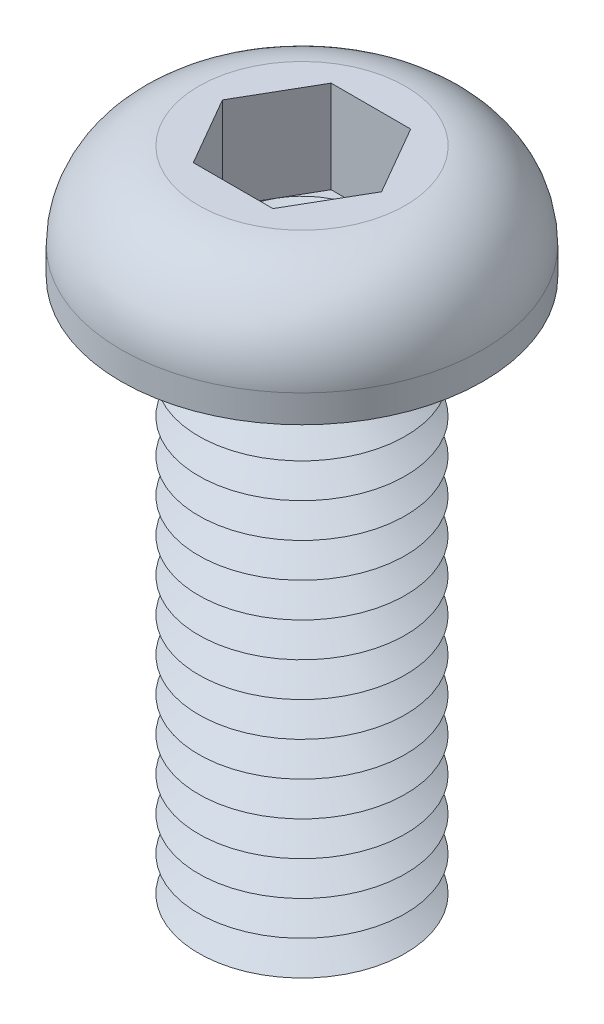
ISO-10303-21;
HEADER;
FILE_DESCRIPTION(('STEP AP214'),'2;1');
FILE_NAME('part.step','',(''),(''),'','','');
FILE_SCHEMA(('AUTOMOTIVE_DESIGN { 1 0 10303 214 1 1 1 1 }'));
ENDSEC;
DATA;
#1=APPLICATION_CONTEXT('core data for automotive mechanical design processes');
#2=APPLICATION_PROTOCOL_DEFINITION('international standard','automotive_design',2000,#1);
#3=PRODUCT_CONTEXT('',#1,'mechanical');
#4=PRODUCT('Part','Part','',(#3));
#5=PRODUCT_RELATED_PRODUCT_CATEGORY('part','',(#4));
#6=PRODUCT_DEFINITION_FORMATION('','',#4);
#7=PRODUCT_DEFINITION_CONTEXT('part definition',#1,'design');
#8=PRODUCT_DEFINITION('design','',#6,#7);
#9=PRODUCT_DEFINITION_SHAPE('','',#8);
#10=(LENGTH_UNIT() NAMED_UNIT(*) SI_UNIT(.MILLI.,.METRE.));
#11=(NAMED_UNIT(*) PLANE_ANGLE_UNIT() SI_UNIT($,.RADIAN.));
#12=(NAMED_UNIT(*) SI_UNIT($,.STERADIAN.) SOLID_ANGLE_UNIT());
#13=UNCERTAINTY_MEASURE_WITH_UNIT(LENGTH_MEASURE(1.E-05),#10,'distance_accuracy_value','');
#14=(GEOMETRIC_REPRESENTATION_CONTEXT(3) GLOBAL_UNCERTAINTY_ASSIGNED_CONTEXT((#13)) GLOBAL_UNIT_ASSIGNED_CONTEXT((#10,
#11,#12)) REPRESENTATION_CONTEXT('',''));
#15=CARTESIAN_POINT('',(0.,0.,0.));
#16=DIRECTION('',(0.,0.,1.));
#17=DIRECTION('',(1.,0.,0.));
#18=AXIS2_PLACEMENT_3D('',#15,#16,#17);
#19=CARTESIAN_POINT('',(0.,0.,0.));
#20=DIRECTION('',(0.,-1.,0.));
#21=DIRECTION('',(0.,0.,-1.));
#22=AXIS2_PLACEMENT_3D('',#19,#20,#21);
#23=TOROIDAL_SURFACE('',#22,3.5,0.5);
#24=CARTESIAN_POINT('',(0.,0.,-4.));
#25=VERTEX_POINT('',#24);
#26=VERTEX_LOOP('',#25);
#27=FACE_BOUND('',#26,.T.);
#28=ADVANCED_FACE('P0_F12',(#27),#23,.T.);
#29=CLOSED_SHELL('',(#28));
#30=MANIFOLD_SOLID_BREP('P0_B1',#29);
#31=CARTESIAN_POINT('',(1.15470053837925,0.62,-2.));
#32=DIRECTION('',(0.,1.,0.));
#33=DIRECTION('',(0.,0.,1.));
#34=AXIS2_PLACEMENT_3D('',#31,#32,#33);
#35=PLANE('',#34);
#36=CARTESIAN_POINT('',(0.,0.62,0.));
#37=DIRECTION('',(0.,1.,0.));
#38=DIRECTION('',(0.,0.,1.));
#39=AXIS2_PLACEMENT_3D('',#36,#37,#38);
#40=CIRCLE('',#39,2.);
#41=CARTESIAN_POINT('',(0.,0.62,2.));
#42=VERTEX_POINT('',#41);
#43=CARTESIAN_POINT('',(1.73205080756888,0.62,1.));
#44=VERTEX_POINT('',#43);
#45=EDGE_CURVE('P1_E93',#42,#44,#40,.T.);
#46=ORIENTED_EDGE('',*,*,#45,.F.);
#47=DIRECTION('',(1.,0.,0.));
#48=VECTOR('',#47,1.);
#49=CARTESIAN_POINT('',(-1.15470053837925,0.62,2.));
#50=LINE('',#49,#48);
#51=CARTESIAN_POINT('',(1.15470053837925,0.62,2.));
#52=VERTEX_POINT('',#51);
#53=EDGE_CURVE('P1_E116',#42,#52,#50,.T.);
#54=ORIENTED_EDGE('',*,*,#53,.T.);
#55=DIRECTION('',(0.5,0.,-0.866025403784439));
#56=VECTOR('',#55,1.);
#57=CARTESIAN_POINT('',(1.15470053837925,0.62,2.));
#58=LINE('',#57,#56);
#59=EDGE_CURVE('P1_E112',#52,#44,#58,.T.);
#60=ORIENTED_EDGE('',*,*,#59,.T.);
#61=EDGE_LOOP('',(#46,#54,#60));
#62=FACE_BOUND('',#61,.T.);
#63=ADVANCED_FACE('P1_F15',(#62),#35,.T.);
#64=CARTESIAN_POINT('',(0.,0.62,0.));
#65=DIRECTION('',(0.,1.,0.));
#66=DIRECTION('',(0.,0.,1.));
#67=AXIS2_PLACEMENT_3D('',#64,#65,#66);
#68=CIRCLE('',#67,2.);
#69=CARTESIAN_POINT('',(1.73205080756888,0.62,-1.));
#70=VERTEX_POINT('',#69);
#71=EDGE_CURVE('P1_E10',#44,#70,#68,.T.);
#72=ORIENTED_EDGE('',*,*,#71,.F.);
#73=CARTESIAN_POINT('',(2.3094010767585,0.62,0.));
#74=VERTEX_POINT('',#73);
#75=EDGE_CURVE('P1_E104',#44,#74,#58,.T.);
#76=ORIENTED_EDGE('',*,*,#75,.T.);
#77=DIRECTION('',(-0.5,0.,-0.866025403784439));
#78=VECTOR('',#77,1.);
#79=CARTESIAN_POINT('',(2.3094010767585,0.62,0.));
#80=LINE('',#79,#78);
#81=EDGE_CURVE('P1_E107',#74,#70,#80,.T.);
#82=ORIENTED_EDGE('',*,*,#81,.T.);
#83=EDGE_LOOP('',(#72,#76,#82));
#84=FACE_BOUND('',#83,.T.);
#85=ADVANCED_FACE('P1_F103',(#84),#35,.T.);
#86=CARTESIAN_POINT('',(0.,0.62,-2.));
#87=VERTEX_POINT('',#86);
#88=EDGE_CURVE('P1_E24',#70,#87,#68,.T.);
#89=ORIENTED_EDGE('',*,*,#88,.F.);
#90=CARTESIAN_POINT('',(1.15470053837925,0.62,-2.));
#91=VERTEX_POINT('',#90);
#92=EDGE_CURVE('P1_E139',#70,#91,#80,.T.);
#93=ORIENTED_EDGE('',*,*,#92,.T.);
#94=DIRECTION('',(-1.,0.,0.));
#95=VECTOR('',#94,1.);
#96=CARTESIAN_POINT('',(1.15470053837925,0.62,-2.));
#97=LINE('',#96,#95);
#98=EDGE_CURVE('P1_E312',#91,#87,#97,.T.);
#99=ORIENTED_EDGE('',*,*,#98,.T.);
#100=EDGE_LOOP('',(#89,#93,#99));
#101=FACE_BOUND('',#100,.T.);
#102=ADVANCED_FACE('P1_F277',(#101),#35,.T.);
#103=CARTESIAN_POINT('',(-1.73205080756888,0.62,-1.));
#104=VERTEX_POINT('',#103);
#105=EDGE_CURVE('P1_E307',#87,#104,#68,.T.);
#106=ORIENTED_EDGE('',*,*,#105,.F.);
#107=CARTESIAN_POINT('',(-1.15470053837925,0.62,-2.));
#108=VERTEX_POINT('',#107);
#109=EDGE_CURVE('P1_E316',#87,#108,#97,.T.);
#110=ORIENTED_EDGE('',*,*,#109,.T.);
#111=DIRECTION('',(-0.5,0.,0.866025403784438));
#112=VECTOR('',#111,1.);
#113=CARTESIAN_POINT('',(-1.15470053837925,0.62,-2.));
#114=LINE('',#113,#112);
#115=EDGE_CURVE('P1_E311',#108,#104,#114,.T.);
#116=ORIENTED_EDGE('',*,*,#115,.T.);
#117=EDGE_LOOP('',(#106,#110,#116));
#118=FACE_BOUND('',#117,.T.);
#119=ADVANCED_FACE('P1_F291',(#118),#35,.T.);
#120=CARTESIAN_POINT('',(-1.73205080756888,0.62,1.));
#121=VERTEX_POINT('',#120);
#122=EDGE_CURVE('P1_E31',#104,#121,#68,.T.);
#123=ORIENTED_EDGE('',*,*,#122,.F.);
#124=CARTESIAN_POINT('',(-2.3094010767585,0.62,0.));
#125=VERTEX_POINT('',#124);
#126=EDGE_CURVE('P1_E303',#104,#125,#114,.T.);
#127=ORIENTED_EDGE('',*,*,#126,.T.);
#128=DIRECTION('',(0.5,0.,0.866025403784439));
#129=VECTOR('',#128,1.);
#130=CARTESIAN_POINT('',(-2.3094010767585,0.62,0.));
#131=LINE('',#130,#129);
#132=EDGE_CURVE('P1_E306',#125,#121,#131,.T.);
#133=ORIENTED_EDGE('',*,*,#132,.T.);
#134=EDGE_LOOP('',(#123,#127,#133));
#135=FACE_BOUND('',#134,.T.);
#136=ADVANCED_FACE('P1_F282',(#135),#35,.T.);
#137=CARTESIAN_POINT('',(0.,-15.,0.));
#138=DIRECTION('',(0.,1.,0.));
#139=DIRECTION('',(0.,0.,1.));
#140=AXIS2_PLACEMENT_3D('',#137,#138,#139);
#141=CONICAL_SURFACE('',#140,2.13397459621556,1.0471975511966);
#142=CARTESIAN_POINT('',(0.,-14.5,0.));
#143=DIRECTION('',(0.,-1.,0.));
#144=DIRECTION('',(0.,0.,-1.));
#145=AXIS2_PLACEMENT_3D('',#142,#143,#144);
#146=CIRCLE('',#145,3.);
#147=CARTESIAN_POINT('',(0.,-14.5,-3.));
#148=VERTEX_POINT('',#147);
#149=EDGE_CURVE('P1_E239',#148,#148,#146,.T.);
#150=ORIENTED_EDGE('',*,*,#149,.T.);
#151=EDGE_LOOP('',(#150));
#152=FACE_BOUND('',#151,.T.);
#153=CARTESIAN_POINT('',(0.,-15.,0.));
#154=DIRECTION('',(0.,-1.,0.));
#155=DIRECTION('',(0.,0.,-1.));
#156=AXIS2_PLACEMENT_3D('',#153,#154,#155);
#157=CIRCLE('',#156,2.13397459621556);
#158=CARTESIAN_POINT('',(0.,-15.,-2.13397459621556));
#159=VERTEX_POINT('',#158);
#160=EDGE_CURVE('P1_E242',#159,#159,#157,.T.);
#161=ORIENTED_EDGE('',*,*,#160,.F.);
#162=EDGE_LOOP('',(#161));
#163=FACE_BOUND('',#162,.T.);
#164=ADVANCED_FACE('P1_F290',(#152,#163),#141,.T.);
#165=CARTESIAN_POINT('',(0.,-15.5,0.));
#166=DIRECTION('',(0.,-1.,0.));
#167=DIRECTION('',(0.,0.,-1.));
#168=AXIS2_PLACEMENT_3D('',#165,#166,#167);
#169=CONICAL_SURFACE('',#168,3.,1.0471975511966);
#170=ORIENTED_EDGE('',*,*,#160,.T.);
#171=EDGE_LOOP('',(#170));
#172=FACE_BOUND('',#171,.T.);
#173=CARTESIAN_POINT('',(0.,-15.5,0.));
#174=DIRECTION('',(0.,-1.,0.));
#175=DIRECTION('',(0.,0.,-1.));
#176=AXIS2_PLACEMENT_3D('',#173,#174,#175);
#177=CIRCLE('',#176,3.);
#178=CARTESIAN_POINT('',(0.,-15.5,-3.));
#179=VERTEX_POINT('',#178);
#180=EDGE_CURVE('P1_E245',#179,#179,#177,.T.);
#181=ORIENTED_EDGE('',*,*,#180,.F.);
#182=EDGE_LOOP('',(#181));
#183=FACE_BOUND('',#182,.T.);
#184=ADVANCED_FACE('P1_F297',(#172,#183),#169,.T.);
#185=CARTESIAN_POINT('',(0.,-16.,0.));
#186=DIRECTION('',(0.,1.,0.));
#187=DIRECTION('',(0.,0.,1.));
#188=AXIS2_PLACEMENT_3D('',#185,#186,#187);
#189=PLANE('',#188);
#190=CARTESIAN_POINT('',(0.,-16.,0.));
#191=DIRECTION('',(0.,-1.,0.));
#192=DIRECTION('',(0.,0.,-1.));
#193=AXIS2_PLACEMENT_3D('',#190,#191,#192);
#194=CIRCLE('',#193,2.13397459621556);
#195=CARTESIAN_POINT('',(0.,-16.,-2.13397459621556));
#196=VERTEX_POINT('',#195);
#197=EDGE_CURVE('P1_E248',#196,#196,#194,.T.);
#198=ORIENTED_EDGE('',*,*,#197,.T.);
#199=EDGE_LOOP('',(#198));
#200=FACE_BOUND('',#199,.T.);
#201=ADVANCED_FACE('P1_F375',(#200),#189,.F.);
#202=CARTESIAN_POINT('',(0.,-16.,0.));
#203=DIRECTION('',(0.,1.,0.));
#204=DIRECTION('',(0.,0.,1.));
#205=AXIS2_PLACEMENT_3D('',#202,#203,#204);
#206=CONICAL_SURFACE('',#205,2.13397459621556,1.0471975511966);
#207=ORIENTED_EDGE('',*,*,#180,.T.);
#208=EDGE_LOOP('',(#207));
#209=FACE_BOUND('',#208,.T.);
#210=ORIENTED_EDGE('',*,*,#197,.F.);
#211=EDGE_LOOP('',(#210));
#212=FACE_BOUND('',#211,.T.);
#213=ADVANCED_FACE('P1_F386',(#209,#212),#206,.T.);
#214=CARTESIAN_POINT('',(0.,-14.,0.));
#215=DIRECTION('',(0.,1.,0.));
#216=DIRECTION('',(0.,0.,1.));
#217=AXIS2_PLACEMENT_3D('',#214,#215,#216);
#218=CONICAL_SURFACE('',#217,2.13397459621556,1.0471975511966);
#219=CARTESIAN_POINT('',(0.,-13.5,0.));
#220=DIRECTION('',(0.,-1.,0.));
#221=DIRECTION('',(0.,0.,-1.));
#222=AXIS2_PLACEMENT_3D('',#219,#220,#221);
#223=CIRCLE('',#222,3.);
#224=CARTESIAN_POINT('',(0.,-13.5,-3.));
#225=VERTEX_POINT('',#224);
#226=EDGE_CURVE('P1_E233',#225,#225,#223,.T.);
#227=ORIENTED_EDGE('',*,*,#226,.T.);
#228=EDGE_LOOP('',(#227));
#229=FACE_BOUND('',#228,.T.);
#230=CARTESIAN_POINT('',(0.,-14.,0.));
#231=DIRECTION('',(0.,-1.,0.));
#232=DIRECTION('',(0.,0.,-1.));
#233=AXIS2_PLACEMENT_3D('',#230,#231,#232);
#234=CIRCLE('',#233,2.13397459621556);
#235=CARTESIAN_POINT('',(0.,-14.,-2.13397459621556));
#236=VERTEX_POINT('',#235);
#237=EDGE_CURVE('P1_E236',#236,#236,#234,.T.);
#238=ORIENTED_EDGE('',*,*,#237,.F.);
#239=EDGE_LOOP('',(#238));
#240=FACE_BOUND('',#239,.T.);
#241=ADVANCED_FACE('P1_F395',(#229,#240),#218,.T.);
#242=CARTESIAN_POINT('',(0.,-14.5,0.));
#243=DIRECTION('',(0.,-1.,0.));
#244=DIRECTION('',(0.,0.,-1.));
#245=AXIS2_PLACEMENT_3D('',#242,#243,#244);
#246=CONICAL_SURFACE('',#245,3.,1.0471975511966);
#247=ORIENTED_EDGE('',*,*,#237,.T.);
#248=EDGE_LOOP('',(#247));
#249=FACE_BOUND('',#248,.T.);
#250=ORIENTED_EDGE('',*,*,#149,.F.);
#251=EDGE_LOOP('',(#250));
#252=FACE_BOUND('',#251,.T.);
#253=ADVANCED_FACE('P1_F404',(#249,#252),#246,.T.);
#254=CARTESIAN_POINT('',(0.,-13.,0.));
#255=DIRECTION('',(0.,1.,0.));
#256=DIRECTION('',(0.,0.,1.));
#257=AXIS2_PLACEMENT_3D('',#254,#255,#256);
#258=CONICAL_SURFACE('',#257,2.13397459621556,1.0471975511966);
#259=CARTESIAN_POINT('',(0.,-12.5,0.));
#260=DIRECTION('',(0.,-1.,0.));
#261=DIRECTION('',(0.,0.,-1.));
#262=AXIS2_PLACEMENT_3D('',#259,#260,#261);
#263=CIRCLE('',#262,3.);
#264=CARTESIAN_POINT('',(0.,-12.5,-3.));
#265=VERTEX_POINT('',#264);
#266=EDGE_CURVE('P1_E227',#265,#265,#263,.T.);
#267=ORIENTED_EDGE('',*,*,#266,.T.);
#268=EDGE_LOOP('',(#267));
#269=FACE_BOUND('',#268,.T.);
#270=CARTESIAN_POINT('',(0.,-13.,0.));
#271=DIRECTION('',(0.,-1.,0.));
#272=DIRECTION('',(0.,0.,-1.));
#273=AXIS2_PLACEMENT_3D('',#270,#271,#272);
#274=CIRCLE('',#273,2.13397459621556);
#275=CARTESIAN_POINT('',(0.,-13.,-2.13397459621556));
#276=VERTEX_POINT('',#275);
#277=EDGE_CURVE('P1_E230',#276,#276,#274,.T.);
#278=ORIENTED_EDGE('',*,*,#277,.F.);
#279=EDGE_LOOP('',(#278));
#280=FACE_BOUND('',#279,.T.);
#281=ADVANCED_FACE('P1_F414',(#269,#280),#258,.T.);
#282=CARTESIAN_POINT('',(0.,-13.5,0.));
#283=DIRECTION('',(0.,-1.,0.));
#284=DIRECTION('',(0.,0.,-1.));
#285=AXIS2_PLACEMENT_3D('',#282,#283,#284);
#286=CONICAL_SURFACE('',#285,3.,1.0471975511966);
#287=ORIENTED_EDGE('',*,*,#277,.T.);
#288=EDGE_LOOP('',(#287));
#289=FACE_BOUND('',#288,.T.);
#290=ORIENTED_EDGE('',*,*,#226,.F.);
#291=EDGE_LOOP('',(#290));
#292=FACE_BOUND('',#291,.T.);
#293=ADVANCED_FACE('P1_F424',(#289,#292),#286,.T.);
#294=CARTESIAN_POINT('',(0.,-12.,0.));
#295=DIRECTION('',(0.,1.,0.));
#296=DIRECTION('',(0.,0.,1.));
#297=AXIS2_PLACEMENT_3D('',#294,#295,#296);
#298=CONICAL_SURFACE('',#297,2.13397459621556,1.0471975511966);
#299=CARTESIAN_POINT('',(0.,-11.5,0.));
#300=DIRECTION('',(0.,-1.,0.));
#301=DIRECTION('',(0.,0.,-1.));
#302=AXIS2_PLACEMENT_3D('',#299,#300,#301);
#303=CIRCLE('',#302,3.);
#304=CARTESIAN_POINT('',(0.,-11.5,-3.));
#305=VERTEX_POINT('',#304);
#306=EDGE_CURVE('P1_E221',#305,#305,#303,.T.);
#307=ORIENTED_EDGE('',*,*,#306,.T.);
#308=EDGE_LOOP('',(#307));
#309=FACE_BOUND('',#308,.T.);
#310=CARTESIAN_POINT('',(0.,-12.,0.));
#311=DIRECTION('',(0.,-1.,0.));
#312=DIRECTION('',(0.,0.,-1.));
#313=AXIS2_PLACEMENT_3D('',#310,#311,#312);
#314=CIRCLE('',#313,2.13397459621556);
#315=CARTESIAN_POINT('',(0.,-12.,-2.13397459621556));
#316=VERTEX_POINT('',#315);
#317=EDGE_CURVE('P1_E224',#316,#316,#314,.T.);
#318=ORIENTED_EDGE('',*,*,#317,.F.);
#319=EDGE_LOOP('',(#318));
#320=FACE_BOUND('',#319,.T.);
#321=ADVANCED_FACE('P1_F434',(#309,#320),#298,.T.);
#322=CARTESIAN_POINT('',(0.,-12.5,0.));
#323=DIRECTION('',(0.,-1.,0.));
#324=DIRECTION('',(0.,0.,-1.));
#325=AXIS2_PLACEMENT_3D('',#322,#323,#324);
#326=CONICAL_SURFACE('',#325,3.,1.0471975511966);
#327=ORIENTED_EDGE('',*,*,#317,.T.);
#328=EDGE_LOOP('',(#327));
#329=FACE_BOUND('',#328,.T.);
#330=ORIENTED_EDGE('',*,*,#266,.F.);
#331=EDGE_LOOP('',(#330));
#332=FACE_BOUND('',#331,.T.);
#333=ADVANCED_FACE('P1_F444',(#329,#332),#326,.T.);
#334=CARTESIAN_POINT('',(0.,-11.,0.));
#335=DIRECTION('',(0.,1.,0.));
#336=DIRECTION('',(0.,0.,1.));
#337=AXIS2_PLACEMENT_3D('',#334,#335,#336);
#338=CONICAL_SURFACE('',#337,2.13397459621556,1.0471975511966);
#339=CARTESIAN_POINT('',(0.,-10.5,0.));
#340=DIRECTION('',(0.,-1.,0.));
#341=DIRECTION('',(0.,0.,-1.));
#342=AXIS2_PLACEMENT_3D('',#339,#340,#341);
#343=CIRCLE('',#342,3.);
#344=CARTESIAN_POINT('',(0.,-10.5,-3.));
#345=VERTEX_POINT('',#344);
#346=EDGE_CURVE('P1_E215',#345,#345,#343,.T.);
#347=ORIENTED_EDGE('',*,*,#346,.T.);
#348=EDGE_LOOP('',(#347));
#349=FACE_BOUND('',#348,.T.);
#350=CARTESIAN_POINT('',(0.,-11.,0.));
#351=DIRECTION('',(0.,-1.,0.));
#352=DIRECTION('',(0.,0.,-1.));
#353=AXIS2_PLACEMENT_3D('',#350,#351,#352);
#354=CIRCLE('',#353,2.13397459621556);
#355=CARTESIAN_POINT('',(0.,-11.,-2.13397459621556));
#356=VERTEX_POINT('',#355);
#357=EDGE_CURVE('P1_E218',#356,#356,#354,.T.);
#358=ORIENTED_EDGE('',*,*,#357,.F.);
#359=EDGE_LOOP('',(#358));
#360=FACE_BOUND('',#359,.T.);
#361=ADVANCED_FACE('P1_F454',(#349,#360),#338,.T.);
#362=CARTESIAN_POINT('',(0.,-11.5,0.));
#363=DIRECTION('',(0.,-1.,0.));
#364=DIRECTION('',(0.,0.,-1.));
#365=AXIS2_PLACEMENT_3D('',#362,#363,#364);
#366=CONICAL_SURFACE('',#365,3.,1.0471975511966);
#367=ORIENTED_EDGE('',*,*,#357,.T.);
#368=EDGE_LOOP('',(#367));
#369=FACE_BOUND('',#368,.T.);
#370=ORIENTED_EDGE('',*,*,#306,.F.);
#371=EDGE_LOOP('',(#370));
#372=FACE_BOUND('',#371,.T.);
#373=ADVANCED_FACE('P1_F464',(#369,#372),#366,.T.);
#374=CARTESIAN_POINT('',(0.,-10.,0.));
#375=DIRECTION('',(0.,1.,0.));
#376=DIRECTION('',(0.,0.,1.));
#377=AXIS2_PLACEMENT_3D('',#374,#375,#376);
#378=CONICAL_SURFACE('',#377,2.13397459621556,1.0471975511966);
#379=CARTESIAN_POINT('',(0.,-9.5,0.));
#380=DIRECTION('',(0.,-1.,0.));
#381=DIRECTION('',(0.,0.,-1.));
#382=AXIS2_PLACEMENT_3D('',#379,#380,#381);
#383=CIRCLE('',#382,3.);
#384=CARTESIAN_POINT('',(0.,-9.5,-3.));
#385=VERTEX_POINT('',#384);
#386=EDGE_CURVE('P1_E209',#385,#385,#383,.T.);
#387=ORIENTED_EDGE('',*,*,#386,.T.);
#388=EDGE_LOOP('',(#387));
#389=FACE_BOUND('',#388,.T.);
#390=CARTESIAN_POINT('',(0.,-10.,0.));
#391=DIRECTION('',(0.,-1.,0.));
#392=DIRECTION('',(0.,0.,-1.));
#393=AXIS2_PLACEMENT_3D('',#390,#391,#392);
#394=CIRCLE('',#393,2.13397459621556);
#395=CARTESIAN_POINT('',(0.,-10.,-2.13397459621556));
#396=VERTEX_POINT('',#395);
#397=EDGE_CURVE('P1_E212',#396,#396,#394,.T.);
#398=ORIENTED_EDGE('',*,*,#397,.F.);
#399=EDGE_LOOP('',(#398));
#400=FACE_BOUND('',#399,.T.);
#401=ADVANCED_FACE('P1_F474',(#389,#400),#378,.T.);
#402=CARTESIAN_POINT('',(0.,-10.5,0.));
#403=DIRECTION('',(0.,-1.,0.));
#404=DIRECTION('',(0.,0.,-1.));
#405=AXIS2_PLACEMENT_3D('',#402,#403,#404);
#406=CONICAL_SURFACE('',#405,3.,1.0471975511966);
#407=ORIENTED_EDGE('',*,*,#397,.T.);
#408=EDGE_LOOP('',(#407));
#409=FACE_BOUND('',#408,.T.);
#410=ORIENTED_EDGE('',*,*,#346,.F.);
#411=EDGE_LOOP('',(#410));
#412=FACE_BOUND('',#411,.T.);
#413=ADVANCED_FACE('P1_F484',(#409,#412),#406,.T.);
#414=CARTESIAN_POINT('',(0.,-9.,0.));
#415=DIRECTION('',(0.,1.,0.));
#416=DIRECTION('',(0.,0.,1.));
#417=AXIS2_PLACEMENT_3D('',#414,#415,#416);
#418=CONICAL_SURFACE('',#417,2.13397459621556,1.0471975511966);
#419=CARTESIAN_POINT('',(0.,-8.5,0.));
#420=DIRECTION('',(0.,-1.,0.));
#421=DIRECTION('',(0.,0.,-1.));
#422=AXIS2_PLACEMENT_3D('',#419,#420,#421);
#423=CIRCLE('',#422,3.);
#424=CARTESIAN_POINT('',(0.,-8.5,-3.));
#425=VERTEX_POINT('',#424);
#426=EDGE_CURVE('P1_E203',#425,#425,#423,.T.);
#427=ORIENTED_EDGE('',*,*,#426,.T.);
#428=EDGE_LOOP('',(#427));
#429=FACE_BOUND('',#428,.T.);
#430=CARTESIAN_POINT('',(0.,-9.,0.));
#431=DIRECTION('',(0.,-1.,0.));
#432=DIRECTION('',(0.,0.,-1.));
#433=AXIS2_PLACEMENT_3D('',#430,#431,#432);
#434=CIRCLE('',#433,2.13397459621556);
#435=CARTESIAN_POINT('',(0.,-9.,-2.13397459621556));
#436=VERTEX_POINT('',#435);
#437=EDGE_CURVE('P1_E206',#436,#436,#434,.T.);
#438=ORIENTED_EDGE('',*,*,#437,.F.);
#439=EDGE_LOOP('',(#438));
#440=FACE_BOUND('',#439,.T.);
#441=ADVANCED_FACE('P1_F494',(#429,#440),#418,.T.);
#442=CARTESIAN_POINT('',(0.,-9.5,0.));
#443=DIRECTION('',(0.,-1.,0.));
#444=DIRECTION('',(0.,0.,-1.));
#445=AXIS2_PLACEMENT_3D('',#442,#443,#444);
#446=CONICAL_SURFACE('',#445,3.,1.0471975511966);
#447=ORIENTED_EDGE('',*,*,#437,.T.);
#448=EDGE_LOOP('',(#447));
#449=FACE_BOUND('',#448,.T.);
#450=ORIENTED_EDGE('',*,*,#386,.F.);
#451=EDGE_LOOP('',(#450));
#452=FACE_BOUND('',#451,.T.);
#453=ADVANCED_FACE('P1_F504',(#449,#452),#446,.T.);
#454=CARTESIAN_POINT('',(0.,-8.,0.));
#455=DIRECTION('',(0.,1.,0.));
#456=DIRECTION('',(0.,0.,1.));
#457=AXIS2_PLACEMENT_3D('',#454,#455,#456);
#458=CONICAL_SURFACE('',#457,2.13397459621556,1.0471975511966);
#459=CARTESIAN_POINT('',(0.,-7.5,0.));
#460=DIRECTION('',(0.,-1.,0.));
#461=DIRECTION('',(0.,0.,-1.));
#462=AXIS2_PLACEMENT_3D('',#459,#460,#461);
#463=CIRCLE('',#462,3.);
#464=CARTESIAN_POINT('',(0.,-7.5,-3.));
#465=VERTEX_POINT('',#464);
#466=EDGE_CURVE('P1_E197',#465,#465,#463,.T.);
#467=ORIENTED_EDGE('',*,*,#466,.T.);
#468=EDGE_LOOP('',(#467));
#469=FACE_BOUND('',#468,.T.);
#470=CARTESIAN_POINT('',(0.,-8.,0.));
#471=DIRECTION('',(0.,-1.,0.));
#472=DIRECTION('',(0.,0.,-1.));
#473=AXIS2_PLACEMENT_3D('',#470,#471,#472);
#474=CIRCLE('',#473,2.13397459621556);
#475=CARTESIAN_POINT('',(0.,-8.,-2.13397459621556));
#476=VERTEX_POINT('',#475);
#477=EDGE_CURVE('P1_E200',#476,#476,#474,.T.);
#478=ORIENTED_EDGE('',*,*,#477,.F.);
#479=EDGE_LOOP('',(#478));
#480=FACE_BOUND('',#479,.T.);
#481=ADVANCED_FACE('P1_F514',(#469,#480),#458,.T.);
#482=CARTESIAN_POINT('',(0.,-8.5,0.));
#483=DIRECTION('',(0.,-1.,0.));
#484=DIRECTION('',(0.,0.,-1.));
#485=AXIS2_PLACEMENT_3D('',#482,#483,#484);
#486=CONICAL_SURFACE('',#485,3.,1.0471975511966);
#487=ORIENTED_EDGE('',*,*,#477,.T.);
#488=EDGE_LOOP('',(#487));
#489=FACE_BOUND('',#488,.T.);
#490=ORIENTED_EDGE('',*,*,#426,.F.);
#491=EDGE_LOOP('',(#490));
#492=FACE_BOUND('',#491,.T.);
#493=ADVANCED_FACE('P1_F524',(#489,#492),#486,.T.);
#494=CARTESIAN_POINT('',(0.,-7.,0.));
#495=DIRECTION('',(0.,1.,0.));
#496=DIRECTION('',(0.,0.,1.));
#497=AXIS2_PLACEMENT_3D('',#494,#495,#496);
#498=CONICAL_SURFACE('',#497,2.13397459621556,1.0471975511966);
#499=CARTESIAN_POINT('',(0.,-6.5,0.));
#500=DIRECTION('',(0.,-1.,0.));
#501=DIRECTION('',(0.,0.,-1.));
#502=AXIS2_PLACEMENT_3D('',#499,#500,#501);
#503=CIRCLE('',#502,3.);
#504=CARTESIAN_POINT('',(0.,-6.5,-3.));
#505=VERTEX_POINT('',#504);
#506=EDGE_CURVE('P1_E191',#505,#505,#503,.T.);
#507=ORIENTED_EDGE('',*,*,#506,.T.);
#508=EDGE_LOOP('',(#507));
#509=FACE_BOUND('',#508,.T.);
#510=CARTESIAN_POINT('',(0.,-7.,0.));
#511=DIRECTION('',(0.,-1.,0.));
#512=DIRECTION('',(0.,0.,-1.));
#513=AXIS2_PLACEMENT_3D('',#510,#511,#512);
#514=CIRCLE('',#513,2.13397459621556);
#515=CARTESIAN_POINT('',(0.,-7.,-2.13397459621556));
#516=VERTEX_POINT('',#515);
#517=EDGE_CURVE('P1_E194',#516,#516,#514,.T.);
#518=ORIENTED_EDGE('',*,*,#517,.F.);
#519=EDGE_LOOP('',(#518));
#520=FACE_BOUND('',#519,.T.);
#521=ADVANCED_FACE('P1_F534',(#509,#520),#498,.T.);
#522=CARTESIAN_POINT('',(0.,-7.5,0.));
#523=DIRECTION('',(0.,-1.,0.));
#524=DIRECTION('',(0.,0.,-1.));
#525=AXIS2_PLACEMENT_3D('',#522,#523,#524);
#526=CONICAL_SURFACE('',#525,3.,1.0471975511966);
#527=ORIENTED_EDGE('',*,*,#517,.T.);
#528=EDGE_LOOP('',(#527));
#529=FACE_BOUND('',#528,.T.);
#530=ORIENTED_EDGE('',*,*,#466,.F.);
#531=EDGE_LOOP('',(#530));
#532=FACE_BOUND('',#531,.T.);
#533=ADVANCED_FACE('P1_F544',(#529,#532),#526,.T.);
#534=CARTESIAN_POINT('',(0.,-6.,0.));
#535=DIRECTION('',(0.,1.,0.));
#536=DIRECTION('',(0.,0.,1.));
#537=AXIS2_PLACEMENT_3D('',#534,#535,#536);
#538=CONICAL_SURFACE('',#537,2.13397459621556,1.0471975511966);
#539=CARTESIAN_POINT('',(0.,-5.5,0.));
#540=DIRECTION('',(0.,-1.,0.));
#541=DIRECTION('',(0.,0.,-1.));
#542=AXIS2_PLACEMENT_3D('',#539,#540,#541);
#543=CIRCLE('',#542,3.);
#544=CARTESIAN_POINT('',(0.,-5.5,-3.));
#545=VERTEX_POINT('',#544);
#546=EDGE_CURVE('P1_E185',#545,#545,#543,.T.);
#547=ORIENTED_EDGE('',*,*,#546,.T.);
#548=EDGE_LOOP('',(#547));
#549=FACE_BOUND('',#548,.T.);
#550=CARTESIAN_POINT('',(0.,-6.,0.));
#551=DIRECTION('',(0.,-1.,0.));
#552=DIRECTION('',(0.,0.,-1.));
#553=AXIS2_PLACEMENT_3D('',#550,#551,#552);
#554=CIRCLE('',#553,2.13397459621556);
#555=CARTESIAN_POINT('',(0.,-6.,-2.13397459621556));
#556=VERTEX_POINT('',#555);
#557=EDGE_CURVE('P1_E188',#556,#556,#554,.T.);
#558=ORIENTED_EDGE('',*,*,#557,.F.);
#559=EDGE_LOOP('',(#558));
#560=FACE_BOUND('',#559,.T.);
#561=ADVANCED_FACE('P1_F554',(#549,#560),#538,.T.);
#562=CARTESIAN_POINT('',(0.,-6.5,0.));
#563=DIRECTION('',(0.,-1.,0.));
#564=DIRECTION('',(0.,0.,-1.));
#565=AXIS2_PLACEMENT_3D('',#562,#563,#564);
#566=CONICAL_SURFACE('',#565,3.,1.0471975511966);
#567=ORIENTED_EDGE('',*,*,#557,.T.);
#568=EDGE_LOOP('',(#567));
#569=FACE_BOUND('',#568,.T.);
#570=ORIENTED_EDGE('',*,*,#506,.F.);
#571=EDGE_LOOP('',(#570));
#572=FACE_BOUND('',#571,.T.);
#573=ADVANCED_FACE('P1_F564',(#569,#572),#566,.T.);
#574=CARTESIAN_POINT('',(0.,-5.,0.));
#575=DIRECTION('',(0.,1.,0.));
#576=DIRECTION('',(0.,0.,1.));
#577=AXIS2_PLACEMENT_3D('',#574,#575,#576);
#578=CONICAL_SURFACE('',#577,2.13397459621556,1.0471975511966);
#579=CARTESIAN_POINT('',(0.,-4.5,0.));
#580=DIRECTION('',(0.,-1.,0.));
#581=DIRECTION('',(0.,0.,-1.));
#582=AXIS2_PLACEMENT_3D('',#579,#580,#581);
#583=CIRCLE('',#582,3.);
#584=CARTESIAN_POINT('',(0.,-4.5,-3.));
#585=VERTEX_POINT('',#584);
#586=EDGE_CURVE('P1_E179',#585,#585,#583,.T.);
#587=ORIENTED_EDGE('',*,*,#586,.T.);
#588=EDGE_LOOP('',(#587));
#589=FACE_BOUND('',#588,.T.);
#590=CARTESIAN_POINT('',(0.,-5.,0.));
#591=DIRECTION('',(0.,-1.,0.));
#592=DIRECTION('',(0.,0.,-1.));
#593=AXIS2_PLACEMENT_3D('',#590,#591,#592);
#594=CIRCLE('',#593,2.13397459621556);
#595=CARTESIAN_POINT('',(0.,-5.,-2.13397459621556));
#596=VERTEX_POINT('',#595);
#597=EDGE_CURVE('P1_E182',#596,#596,#594,.T.);
#598=ORIENTED_EDGE('',*,*,#597,.F.);
#599=EDGE_LOOP('',(#598));
#600=FACE_BOUND('',#599,.T.);
#601=ADVANCED_FACE('P1_F574',(#589,#600),#578,.T.);
#602=CARTESIAN_POINT('',(0.,-5.5,0.));
#603=DIRECTION('',(0.,-1.,0.));
#604=DIRECTION('',(0.,0.,-1.));
#605=AXIS2_PLACEMENT_3D('',#602,#603,#604);
#606=CONICAL_SURFACE('',#605,3.,1.0471975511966);
#607=ORIENTED_EDGE('',*,*,#597,.T.);
#608=EDGE_LOOP('',(#607));
#609=FACE_BOUND('',#608,.T.);
#610=ORIENTED_EDGE('',*,*,#546,.F.);
#611=EDGE_LOOP('',(#610));
#612=FACE_BOUND('',#611,.T.);
#613=ADVANCED_FACE('P1_F584',(#609,#612),#606,.T.);
#614=CARTESIAN_POINT('',(0.,-4.,0.));
#615=DIRECTION('',(0.,1.,0.));
#616=DIRECTION('',(0.,0.,1.));
#617=AXIS2_PLACEMENT_3D('',#614,#615,#616);
#618=CONICAL_SURFACE('',#617,2.13397459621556,1.0471975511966);
#619=CARTESIAN_POINT('',(0.,-3.5,0.));
#620=DIRECTION('',(0.,-1.,0.));
#621=DIRECTION('',(0.,0.,-1.));
#622=AXIS2_PLACEMENT_3D('',#619,#620,#621);
#623=CIRCLE('',#622,3.);
#624=CARTESIAN_POINT('',(0.,-3.5,-3.));
#625=VERTEX_POINT('',#624);
#626=EDGE_CURVE('P1_E173',#625,#625,#623,.T.);
#627=ORIENTED_EDGE('',*,*,#626,.T.);
#628=EDGE_LOOP('',(#627));
#629=FACE_BOUND('',#628,.T.);
#630=CARTESIAN_POINT('',(0.,-4.,0.));
#631=DIRECTION('',(0.,-1.,0.));
#632=DIRECTION('',(0.,0.,-1.));
#633=AXIS2_PLACEMENT_3D('',#630,#631,#632);
#634=CIRCLE('',#633,2.13397459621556);
#635=CARTESIAN_POINT('',(0.,-4.,-2.13397459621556));
#636=VERTEX_POINT('',#635);
#637=EDGE_CURVE('P1_E176',#636,#636,#634,.T.);
#638=ORIENTED_EDGE('',*,*,#637,.F.);
#639=EDGE_LOOP('',(#638));
#640=FACE_BOUND('',#639,.T.);
#641=ADVANCED_FACE('P1_F594',(#629,#640),#618,.T.);
#642=CARTESIAN_POINT('',(0.,-4.5,0.));
#643=DIRECTION('',(0.,-1.,0.));
#644=DIRECTION('',(0.,0.,-1.));
#645=AXIS2_PLACEMENT_3D('',#642,#643,#644);
#646=CONICAL_SURFACE('',#645,3.,1.0471975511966);
#647=ORIENTED_EDGE('',*,*,#637,.T.);
#648=EDGE_LOOP('',(#647));
#649=FACE_BOUND('',#648,.T.);
#650=ORIENTED_EDGE('',*,*,#586,.F.);
#651=EDGE_LOOP('',(#650));
#652=FACE_BOUND('',#651,.T.);
#653=ADVANCED_FACE('P1_F604',(#649,#652),#646,.T.);
#654=CARTESIAN_POINT('',(0.,-3.,0.));
#655=DIRECTION('',(0.,1.,0.));
#656=DIRECTION('',(0.,0.,1.));
#657=AXIS2_PLACEMENT_3D('',#654,#655,#656);
#658=CONICAL_SURFACE('',#657,2.13397459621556,1.0471975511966);
#659=CARTESIAN_POINT('',(0.,-2.5,0.));
#660=DIRECTION('',(0.,-1.,0.));
#661=DIRECTION('',(0.,0.,-1.));
#662=AXIS2_PLACEMENT_3D('',#659,#660,#661);
#663=CIRCLE('',#662,3.);
#664=CARTESIAN_POINT('',(0.,-2.5,-3.));
#665=VERTEX_POINT('',#664);
#666=EDGE_CURVE('P1_E164',#665,#665,#663,.T.);
#667=ORIENTED_EDGE('',*,*,#666,.T.);
#668=EDGE_LOOP('',(#667));
#669=FACE_BOUND('',#668,.T.);
#670=CARTESIAN_POINT('',(0.,-3.,0.));
#671=DIRECTION('',(0.,-1.,0.));
#672=DIRECTION('',(0.,0.,-1.));
#673=AXIS2_PLACEMENT_3D('',#670,#671,#672);
#674=CIRCLE('',#673,2.13397459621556);
#675=CARTESIAN_POINT('',(0.,-3.,-2.13397459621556));
#676=VERTEX_POINT('',#675);
#677=EDGE_CURVE('P1_E170',#676,#676,#674,.T.);
#678=ORIENTED_EDGE('',*,*,#677,.F.);
#679=EDGE_LOOP('',(#678));
#680=FACE_BOUND('',#679,.T.);
#681=ADVANCED_FACE('P1_F614',(#669,#680),#658,.T.);
#682=CARTESIAN_POINT('',(0.,-3.5,0.));
#683=DIRECTION('',(0.,-1.,0.));
#684=DIRECTION('',(0.,0.,-1.));
#685=AXIS2_PLACEMENT_3D('',#682,#683,#684);
#686=CONICAL_SURFACE('',#685,3.,1.0471975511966);
#687=ORIENTED_EDGE('',*,*,#677,.T.);
#688=EDGE_LOOP('',(#687));
#689=FACE_BOUND('',#688,.T.);
#690=ORIENTED_EDGE('',*,*,#626,.F.);
#691=EDGE_LOOP('',(#690));
#692=FACE_BOUND('',#691,.T.);
#693=ADVANCED_FACE('P1_F624',(#689,#692),#686,.T.);
#694=CARTESIAN_POINT('',(0.,-2.,0.));
#695=DIRECTION('',(0.,1.,0.));
#696=DIRECTION('',(0.,0.,1.));
#697=AXIS2_PLACEMENT_3D('',#694,#695,#696);
#698=CONICAL_SURFACE('',#697,2.13397459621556,1.0471975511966);
#699=CARTESIAN_POINT('',(0.,-1.5,0.));
#700=DIRECTION('',(0.,-1.,0.));
#701=DIRECTION('',(0.,0.,-1.));
#702=AXIS2_PLACEMENT_3D('',#699,#700,#701);
#703=CIRCLE('',#702,3.);
#704=CARTESIAN_POINT('',(0.,-1.5,-3.));
#705=VERTEX_POINT('',#704);
#706=EDGE_CURVE('P1_E167',#705,#705,#703,.T.);
#707=ORIENTED_EDGE('',*,*,#706,.T.);
#708=EDGE_LOOP('',(#707));
#709=FACE_BOUND('',#708,.T.);
#710=CARTESIAN_POINT('',(0.,-2.,0.));
#711=DIRECTION('',(0.,-1.,0.));
#712=DIRECTION('',(0.,0.,-1.));
#713=AXIS2_PLACEMENT_3D('',#710,#711,#712);
#714=CIRCLE('',#713,2.13397459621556);
#715=CARTESIAN_POINT('',(0.,-2.,-2.13397459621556));
#716=VERTEX_POINT('',#715);
#717=EDGE_CURVE('P1_E161',#716,#716,#714,.T.);
#718=ORIENTED_EDGE('',*,*,#717,.F.);
#719=EDGE_LOOP('',(#718));
#720=FACE_BOUND('',#719,.T.);
#721=ADVANCED_FACE('P1_F634',(#709,#720),#698,.T.);
#722=CARTESIAN_POINT('',(0.,-2.5,0.));
#723=DIRECTION('',(0.,-1.,0.));
#724=DIRECTION('',(0.,0.,-1.));
#725=AXIS2_PLACEMENT_3D('',#722,#723,#724);
#726=CONICAL_SURFACE('',#725,3.,1.0471975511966);
#727=ORIENTED_EDGE('',*,*,#717,.T.);
#728=EDGE_LOOP('',(#727));
#729=FACE_BOUND('',#728,.T.);
#730=ORIENTED_EDGE('',*,*,#666,.F.);
#731=EDGE_LOOP('',(#730));
#732=FACE_BOUND('',#731,.T.);
#733=ADVANCED_FACE('P1_F644',(#729,#732),#726,.T.);
#734=CARTESIAN_POINT('',(0.,-16.,0.));
#735=DIRECTION('',(0.,1.,0.));
#736=DIRECTION('',(0.,0.,1.));
#737=AXIS2_PLACEMENT_3D('',#734,#735,#736);
#738=CYLINDRICAL_SURFACE('',#737,3.);
#739=CARTESIAN_POINT('',(0.,0.,0.));
#740=DIRECTION('',(0.,-1.,0.));
#741=DIRECTION('',(1.,0.,0.));
#742=AXIS2_PLACEMENT_3D('',#739,#740,#741);
#743=CIRCLE('',#742,3.);
#744=CARTESIAN_POINT('',(3.,0.,0.));
#745=VERTEX_POINT('',#744);
#746=EDGE_CURVE('P1_E141',#745,#745,#743,.F.);
#747=ORIENTED_EDGE('',*,*,#746,.F.);
#748=EDGE_LOOP('',(#747));
#749=FACE_BOUND('',#748,.T.);
#750=ORIENTED_EDGE('',*,*,#706,.F.);
#751=EDGE_LOOP('',(#750));
#752=FACE_BOUND('',#751,.T.);
#753=ADVANCED_FACE('P1_F17',(#749,#752),#738,.T.);
#754=CARTESIAN_POINT('',(0.,0.,0.));
#755=DIRECTION('',(0.,-1.,0.));
#756=DIRECTION('',(0.,0.,-1.));
#757=AXIS2_PLACEMENT_3D('',#754,#755,#756);
#758=TOROIDAL_SURFACE('',#757,3.5,0.5);
#759=ORIENTED_EDGE('',*,*,#746,.T.);
#760=EDGE_LOOP('',(#759));
#761=FACE_BOUND('',#760,.T.);
#762=CARTESIAN_POINT('',(0.,0.,0.));
#763=DIRECTION('',(0.,1.,0.));
#764=DIRECTION('',(-1.,0.,0.));
#765=AXIS2_PLACEMENT_3D('',#762,#763,#764);
#766=CIRCLE('',#765,4.);
#767=CARTESIAN_POINT('',(-4.,0.,0.));
#768=VERTEX_POINT('',#767);
#769=EDGE_CURVE('P1_E151',#768,#768,#766,.F.);
#770=ORIENTED_EDGE('',*,*,#769,.T.);
#771=EDGE_LOOP('',(#770));
#772=FACE_BOUND('',#771,.T.);
#773=ADVANCED_FACE('P1_F253',(#761,#772),#758,.F.);
#774=CARTESIAN_POINT('',(3.,3.3,0.));
#775=DIRECTION('',(0.,-1.,0.));
#776=DIRECTION('',(1.,0.,0.));
#777=AXIS2_PLACEMENT_3D('',#774,#775,#776);
#778=PLANE('',#777);
#779=DIRECTION('',(-1.,0.,0.));
#780=VECTOR('',#779,1.);
#781=CARTESIAN_POINT('',(1.15470053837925,3.3,-2.));
#782=LINE('',#781,#780);
#783=CARTESIAN_POINT('',(1.15470053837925,3.3,-2.));
#784=VERTEX_POINT('',#783);
#785=CARTESIAN_POINT('',(-1.15470053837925,3.3,-2.));
#786=VERTEX_POINT('',#785);
#787=EDGE_CURVE('P1_E125',#784,#786,#782,.T.);
#788=ORIENTED_EDGE('',*,*,#787,.F.);
#789=DIRECTION('',(-0.5,0.,-0.866025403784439));
#790=VECTOR('',#789,1.);
#791=CARTESIAN_POINT('',(2.3094010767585,3.3,0.));
#792=LINE('',#791,#790);
#793=CARTESIAN_POINT('',(2.3094010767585,3.3,0.));
#794=VERTEX_POINT('',#793);
#795=EDGE_CURVE('P1_E39',#794,#784,#792,.T.);
#796=ORIENTED_EDGE('',*,*,#795,.F.);
#797=DIRECTION('',(0.5,0.,-0.866025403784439));
#798=VECTOR('',#797,1.);
#799=CARTESIAN_POINT('',(1.15470053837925,3.3,2.));
#800=LINE('',#799,#798);
#801=CARTESIAN_POINT('',(1.15470053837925,3.3,2.));
#802=VERTEX_POINT('',#801);
#803=EDGE_CURVE('P1_E137',#802,#794,#800,.T.);
#804=ORIENTED_EDGE('',*,*,#803,.F.);
#805=DIRECTION('',(1.,0.,0.));
#806=VECTOR('',#805,1.);
#807=CARTESIAN_POINT('',(-1.15470053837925,3.3,2.));
#808=LINE('',#807,#806);
#809=CARTESIAN_POINT('',(-1.15470053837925,3.3,2.));
#810=VERTEX_POINT('',#809);
#811=EDGE_CURVE('P1_E134',#810,#802,#808,.T.);
#812=ORIENTED_EDGE('',*,*,#811,.F.);
#813=DIRECTION('',(0.5,0.,0.866025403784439));
#814=VECTOR('',#813,1.);
#815=CARTESIAN_POINT('',(-2.3094010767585,3.3,0.));
#816=LINE('',#815,#814);
#817=CARTESIAN_POINT('',(-2.3094010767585,3.3,0.));
#818=VERTEX_POINT('',#817);
#819=EDGE_CURVE('P1_E131',#818,#810,#816,.T.);
#820=ORIENTED_EDGE('',*,*,#819,.F.);
#821=DIRECTION('',(-0.5,0.,0.866025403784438));
#822=VECTOR('',#821,1.);
#823=CARTESIAN_POINT('',(-1.15470053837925,3.3,-2.));
#824=LINE('',#823,#822);
#825=EDGE_CURVE('P1_E128',#786,#818,#824,.T.);
#826=ORIENTED_EDGE('',*,*,#825,.F.);
#827=EDGE_LOOP('',(#788,#796,#804,#812,#820,#826));
#828=FACE_BOUND('',#827,.T.);
#829=CARTESIAN_POINT('',(0.,3.3,0.));
#830=DIRECTION('',(0.,1.,0.));
#831=DIRECTION('',(-1.,0.,0.));
#832=AXIS2_PLACEMENT_3D('',#829,#830,#831);
#833=CIRCLE('',#832,3.);
#834=CARTESIAN_POINT('',(-3.,3.3,0.));
#835=VERTEX_POINT('',#834);
#836=EDGE_CURVE('P1_E152',#835,#835,#833,.T.);
#837=ORIENTED_EDGE('',*,*,#836,.T.);
#838=EDGE_LOOP('',(#837));
#839=FACE_BOUND('',#838,.T.);
#840=ADVANCED_FACE('P1_F331',(#828,#839),#778,.F.);
#841=CARTESIAN_POINT('',(0.,0.8,0.));
#842=DIRECTION('',(0.,1.,0.));
#843=DIRECTION('',(-1.,0.,0.));
#844=AXIS2_PLACEMENT_3D('',#841,#842,#843);
#845=TOROIDAL_SURFACE('',#844,2.73611111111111,2.51388888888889);
#846=ORIENTED_EDGE('',*,*,#836,.F.);
#847=EDGE_LOOP('',(#846));
#848=FACE_BOUND('',#847,.T.);
#849=CARTESIAN_POINT('',(0.,0.8,0.));
#850=DIRECTION('',(0.,1.,0.));
#851=DIRECTION('',(-1.,0.,0.));
#852=AXIS2_PLACEMENT_3D('',#849,#850,#851);
#853=CIRCLE('',#852,5.25);
#854=CARTESIAN_POINT('',(-5.25,0.8,0.));
#855=VERTEX_POINT('',#854);
#856=EDGE_CURVE('P1_E155',#855,#855,#853,.T.);
#857=ORIENTED_EDGE('',*,*,#856,.T.);
#858=EDGE_LOOP('',(#857));
#859=FACE_BOUND('',#858,.T.);
#860=ADVANCED_FACE('P1_F267',(#848,#859),#845,.T.);
#861=CARTESIAN_POINT('',(0.,3.3,0.));
#862=DIRECTION('',(0.,1.,0.));
#863=DIRECTION('',(-1.,0.,0.));
#864=AXIS2_PLACEMENT_3D('',#861,#862,#863);
#865=CYLINDRICAL_SURFACE('',#864,5.25);
#866=ORIENTED_EDGE('',*,*,#856,.F.);
#867=EDGE_LOOP('',(#866));
#868=FACE_BOUND('',#867,.T.);
#869=CARTESIAN_POINT('',(0.,0.,0.));
#870=DIRECTION('',(0.,1.,0.));
#871=DIRECTION('',(-1.,0.,0.));
#872=AXIS2_PLACEMENT_3D('',#869,#870,#871);
#873=CIRCLE('',#872,5.25);
#874=CARTESIAN_POINT('',(-5.25,0.,0.));
#875=VERTEX_POINT('',#874);
#876=EDGE_CURVE('P1_E158',#875,#875,#873,.T.);
#877=ORIENTED_EDGE('',*,*,#876,.T.);
#878=EDGE_LOOP('',(#877));
#879=FACE_BOUND('',#878,.T.);
#880=ADVANCED_FACE('P1_F258',(#868,#879),#865,.T.);
#881=CARTESIAN_POINT('',(0.,0.,0.));
#882=DIRECTION('',(0.,1.,0.));
#883=DIRECTION('',(-1.,0.,0.));
#884=AXIS2_PLACEMENT_3D('',#881,#882,#883);
#885=PLANE('',#884);
#886=ORIENTED_EDGE('',*,*,#876,.F.);
#887=EDGE_LOOP('',(#886));
#888=FACE_BOUND('',#887,.T.);
#889=ORIENTED_EDGE('',*,*,#769,.F.);
#890=EDGE_LOOP('',(#889));
#891=FACE_BOUND('',#890,.T.);
#892=ADVANCED_FACE('P1_F255',(#888,#891),#885,.F.);
#893=CARTESIAN_POINT('',(2.3094010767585,0.62,0.));
#894=DIRECTION('',(0.866025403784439,0.,-0.5));
#895=DIRECTION('',(-0.5,0.,-0.866025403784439));
#896=AXIS2_PLACEMENT_3D('',#893,#894,#895);
#897=PLANE('',#896);
#898=ORIENTED_EDGE('',*,*,#795,.T.);
#899=DIRECTION('',(0.,1.,0.));
#900=VECTOR('',#899,1.);
#901=CARTESIAN_POINT('',(1.15470053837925,0.62,-2.));
#902=LINE('',#901,#900);
#903=EDGE_CURVE('P1_E118',#91,#784,#902,.T.);
#904=ORIENTED_EDGE('',*,*,#903,.F.);
#905=ORIENTED_EDGE('',*,*,#92,.F.);
#906=ORIENTED_EDGE('',*,*,#81,.F.);
#907=DIRECTION('',(0.,1.,0.));
#908=VECTOR('',#907,1.);
#909=CARTESIAN_POINT('',(2.3094010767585,0.62,0.));
#910=LINE('',#909,#908);
#911=EDGE_CURVE('P1_E113',#74,#794,#910,.T.);
#912=ORIENTED_EDGE('',*,*,#911,.T.);
#913=EDGE_LOOP('',(#898,#904,#905,#906,#912));
#914=FACE_BOUND('',#913,.T.);
#915=ADVANCED_FACE('P1_F257',(#914),#897,.F.);
#916=CARTESIAN_POINT('',(1.15470053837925,0.62,2.));
#917=DIRECTION('',(0.866025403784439,0.,0.5));
#918=DIRECTION('',(0.5,0.,-0.866025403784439));
#919=AXIS2_PLACEMENT_3D('',#916,#917,#918);
#920=PLANE('',#919);
#921=ORIENTED_EDGE('',*,*,#803,.T.);
#922=ORIENTED_EDGE('',*,*,#911,.F.);
#923=ORIENTED_EDGE('',*,*,#75,.F.);
#924=ORIENTED_EDGE('',*,*,#59,.F.);
#925=DIRECTION('',(0.,1.,0.));
#926=VECTOR('',#925,1.);
#927=CARTESIAN_POINT('',(1.15470053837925,0.62,2.));
#928=LINE('',#927,#926);
#929=EDGE_CURVE('P1_E142',#52,#802,#928,.T.);
#930=ORIENTED_EDGE('',*,*,#929,.T.);
#931=EDGE_LOOP('',(#921,#922,#923,#924,#930));
#932=FACE_BOUND('',#931,.T.);
#933=ADVANCED_FACE('P1_F111',(#932),#920,.F.);
#934=CARTESIAN_POINT('',(-1.15470053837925,0.62,2.));
#935=DIRECTION('',(0.,0.,1.));
#936=DIRECTION('',(1.,0.,0.));
#937=AXIS2_PLACEMENT_3D('',#934,#935,#936);
#938=PLANE('',#937);
#939=ORIENTED_EDGE('',*,*,#811,.T.);
#940=ORIENTED_EDGE('',*,*,#929,.F.);
#941=ORIENTED_EDGE('',*,*,#53,.F.);
#942=CARTESIAN_POINT('',(-1.15470053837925,0.62,2.));
#943=VERTEX_POINT('',#942);
#944=EDGE_CURVE('P1_E114',#943,#42,#50,.T.);
#945=ORIENTED_EDGE('',*,*,#944,.F.);
#946=DIRECTION('',(0.,1.,0.));
#947=VECTOR('',#946,1.);
#948=CARTESIAN_POINT('',(-1.15470053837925,0.62,2.));
#949=LINE('',#948,#947);
#950=EDGE_CURVE('P1_E144',#943,#810,#949,.T.);
#951=ORIENTED_EDGE('',*,*,#950,.T.);
#952=EDGE_LOOP('',(#939,#940,#941,#945,#951));
#953=FACE_BOUND('',#952,.T.);
#954=ADVANCED_FACE('P1_F326',(#953),#938,.F.);
#955=CARTESIAN_POINT('',(-2.3094010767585,0.62,0.));
#956=DIRECTION('',(-0.866025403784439,0.,0.5));
#957=DIRECTION('',(0.5,0.,0.866025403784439));
#958=AXIS2_PLACEMENT_3D('',#955,#956,#957);
#959=PLANE('',#958);
#960=ORIENTED_EDGE('',*,*,#819,.T.);
#961=ORIENTED_EDGE('',*,*,#950,.F.);
#962=EDGE_CURVE('P1_E318',#121,#943,#131,.T.);
#963=ORIENTED_EDGE('',*,*,#962,.F.);
#964=ORIENTED_EDGE('',*,*,#132,.F.);
#965=DIRECTION('',(0.,1.,0.));
#966=VECTOR('',#965,1.);
#967=CARTESIAN_POINT('',(-2.3094010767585,0.62,0.));
#968=LINE('',#967,#966);
#969=EDGE_CURVE('P1_E146',#125,#818,#968,.T.);
#970=ORIENTED_EDGE('',*,*,#969,.T.);
#971=EDGE_LOOP('',(#960,#961,#963,#964,#970));
#972=FACE_BOUND('',#971,.T.);
#973=ADVANCED_FACE('P1_F722',(#972),#959,.F.);
#974=CARTESIAN_POINT('',(-1.15470053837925,0.62,-2.));
#975=DIRECTION('',(-0.866025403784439,0.,-0.5));
#976=DIRECTION('',(-0.5,0.,0.866025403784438));
#977=AXIS2_PLACEMENT_3D('',#974,#975,#976);
#978=PLANE('',#977);
#979=ORIENTED_EDGE('',*,*,#825,.T.);
#980=ORIENTED_EDGE('',*,*,#969,.F.);
#981=ORIENTED_EDGE('',*,*,#126,.F.);
#982=ORIENTED_EDGE('',*,*,#115,.F.);
#983=DIRECTION('',(0.,1.,0.));
#984=VECTOR('',#983,1.);
#985=CARTESIAN_POINT('',(-1.15470053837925,0.62,-2.));
#986=LINE('',#985,#984);
#987=EDGE_CURVE('P1_E119',#108,#786,#986,.T.);
#988=ORIENTED_EDGE('',*,*,#987,.T.);
#989=EDGE_LOOP('',(#979,#980,#981,#982,#988));
#990=FACE_BOUND('',#989,.T.);
#991=ADVANCED_FACE('P1_F286',(#990),#978,.F.);
#992=CARTESIAN_POINT('',(1.15470053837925,0.62,-2.));
#993=DIRECTION('',(0.,0.,-1.));
#994=DIRECTION('',(-1.,0.,0.));
#995=AXIS2_PLACEMENT_3D('',#992,#993,#994);
#996=PLANE('',#995);
#997=ORIENTED_EDGE('',*,*,#787,.T.);
#998=ORIENTED_EDGE('',*,*,#987,.F.);
#999=ORIENTED_EDGE('',*,*,#109,.F.);
#1000=ORIENTED_EDGE('',*,*,#98,.F.);
#1001=ORIENTED_EDGE('',*,*,#903,.T.);
#1002=EDGE_LOOP('',(#997,#998,#999,#1000,#1001));
#1003=FACE_BOUND('',#1002,.T.);
#1004=ADVANCED_FACE('P1_F280',(#1003),#996,.F.);
#1005=EDGE_CURVE('P1_E19',#121,#42,#68,.T.);
#1006=ORIENTED_EDGE('',*,*,#1005,.F.);
#1007=ORIENTED_EDGE('',*,*,#962,.T.);
#1008=ORIENTED_EDGE('',*,*,#944,.T.);
#1009=EDGE_LOOP('',(#1006,#1007,#1008));
#1010=FACE_BOUND('',#1009,.T.);
#1011=ADVANCED_FACE('P1_F90',(#1010),#35,.T.);
#1012=CARTESIAN_POINT('',(0.,0.62,0.));
#1013=DIRECTION('',(0.,1.,0.));
#1014=DIRECTION('',(0.,0.,1.));
#1015=AXIS2_PLACEMENT_3D('',#1012,#1013,#1014);
#1016=CONICAL_SURFACE('',#1015,2.,1.0471975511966);
#1017=CARTESIAN_POINT('',(0.,-0.534700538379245,0.));
#1018=VERTEX_POINT('',#1017);
#1019=VERTEX_LOOP('',#1018);
#1020=FACE_BOUND('',#1019,.T.);
#1021=ORIENTED_EDGE('',*,*,#45,.T.);
#1022=ORIENTED_EDGE('',*,*,#71,.T.);
#1023=ORIENTED_EDGE('',*,*,#88,.T.);
#1024=ORIENTED_EDGE('',*,*,#105,.T.);
#1025=ORIENTED_EDGE('',*,*,#122,.T.);
#1026=ORIENTED_EDGE('',*,*,#1005,.T.);
#1027=EDGE_LOOP('',(#1021,#1022,#1023,#1024,#1025,#1026));
#1028=FACE_BOUND('',#1027,.T.);
#1029=ADVANCED_FACE('P1_F88',(#1020,#1028),#1016,.F.);
#1030=CLOSED_SHELL('',(#63,#85,#102,#119,#136,#164,#184,#201,#213,#241,#253,#281,#293,#321,#333,
#361,#373,#401,#413,#441,#453,#481,#493,#521,#533,#561,#573,#601,#613,#641,#653,#681,#693,#721,
#733,#753,#773,#840,#860,#880,#892,#915,#933,#954,#973,#991,#1004,#1011,#1029));
#1031=MANIFOLD_SOLID_BREP('P1_B1',#1030);
#1032=ADVANCED_BREP_SHAPE_REPRESENTATION('',(#18,#30,#1031),#14);
#1033=SHAPE_DEFINITION_REPRESENTATION(#9,#1032);
ENDSEC;
END-ISO-10303-21;
